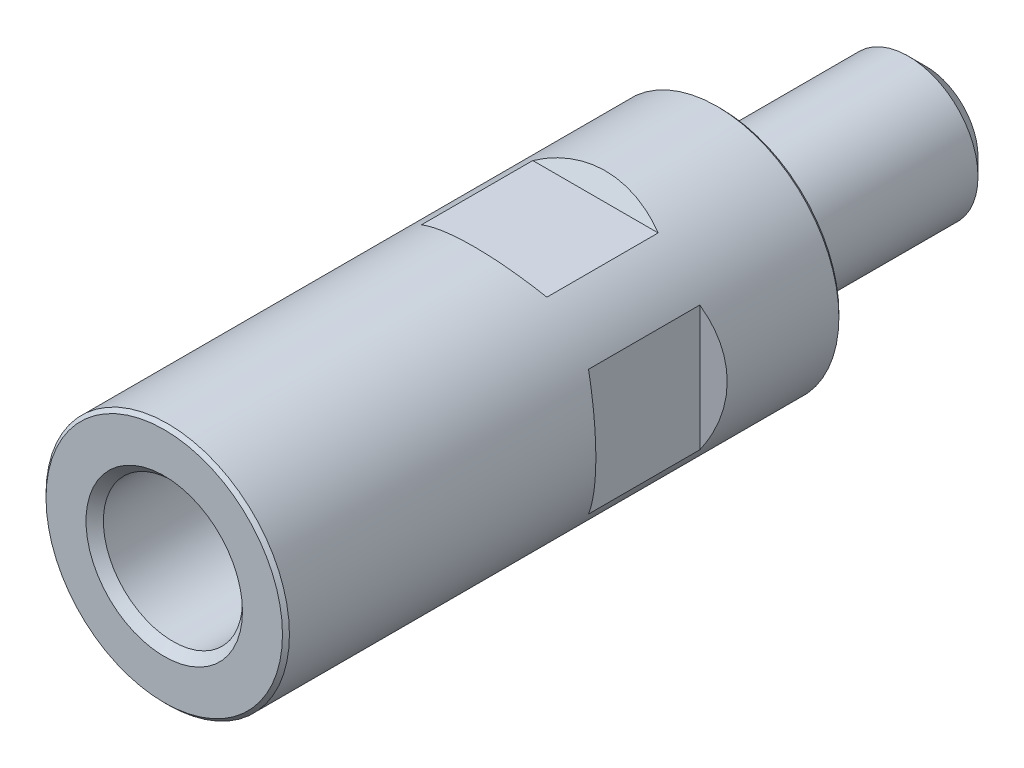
ISO-10303-21;
HEADER;
FILE_DESCRIPTION(('STEP AP214'),'2;1');
FILE_NAME('part.step','',(''),(''),'','','');
FILE_SCHEMA(('AUTOMOTIVE_DESIGN { 1 0 10303 214 1 1 1 1 }'));
ENDSEC;
DATA;
#1=APPLICATION_CONTEXT('core data for automotive mechanical design processes');
#2=APPLICATION_PROTOCOL_DEFINITION('international standard','automotive_design',2000,#1);
#3=PRODUCT_CONTEXT('',#1,'mechanical');
#4=PRODUCT('Part','Part','',(#3));
#5=PRODUCT_RELATED_PRODUCT_CATEGORY('part','',(#4));
#6=PRODUCT_DEFINITION_FORMATION('','',#4);
#7=PRODUCT_DEFINITION_CONTEXT('part definition',#1,'design');
#8=PRODUCT_DEFINITION('design','',#6,#7);
#9=PRODUCT_DEFINITION_SHAPE('','',#8);
#10=(LENGTH_UNIT() NAMED_UNIT(*) SI_UNIT(.MILLI.,.METRE.));
#11=(NAMED_UNIT(*) PLANE_ANGLE_UNIT() SI_UNIT($,.RADIAN.));
#12=(NAMED_UNIT(*) SI_UNIT($,.STERADIAN.) SOLID_ANGLE_UNIT());
#13=UNCERTAINTY_MEASURE_WITH_UNIT(LENGTH_MEASURE(1.E-05),#10,'distance_accuracy_value','');
#14=(GEOMETRIC_REPRESENTATION_CONTEXT(3) GLOBAL_UNCERTAINTY_ASSIGNED_CONTEXT((#13)) GLOBAL_UNIT_ASSIGNED_CONTEXT((#10,
#11,#12)) REPRESENTATION_CONTEXT('',''));
#15=CARTESIAN_POINT('',(0.,0.,0.));
#16=DIRECTION('',(0.,0.,1.));
#17=DIRECTION('',(1.,0.,0.));
#18=AXIS2_PLACEMENT_3D('',#15,#16,#17);
#19=CARTESIAN_POINT('',(0.,0.,2.5));
#20=DIRECTION('',(0.,0.,-1.));
#21=DIRECTION('',(-1.,0.,0.));
#22=AXIS2_PLACEMENT_3D('',#19,#20,#21);
#23=CONICAL_SURFACE('',#22,8.75,0.785398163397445);
#24=CARTESIAN_POINT('',(0.,0.,0.));
#25=DIRECTION('',(0.,0.,1.));
#26=DIRECTION('',(1.,0.,0.));
#27=AXIS2_PLACEMENT_3D('',#24,#25,#26);
#28=CIRCLE('',#27,11.25);
#29=CARTESIAN_POINT('',(11.25,0.,0.));
#30=VERTEX_POINT('',#29);
#31=EDGE_CURVE('E103',#30,#30,#28,.T.);
#32=ORIENTED_EDGE('',*,*,#31,.F.);
#33=EDGE_LOOP('',(#32));
#34=FACE_BOUND('',#33,.T.);
#35=CARTESIAN_POINT('',(0.,0.,1.25));
#36=DIRECTION('',(0.,0.,-1.));
#37=DIRECTION('',(-1.,0.,0.));
#38=AXIS2_PLACEMENT_3D('',#35,#36,#37);
#39=CIRCLE('',#38,10.);
#40=CARTESIAN_POINT('',(-10.,0.,1.25));
#41=VERTEX_POINT('',#40);
#42=EDGE_CURVE('E9',#41,#41,#39,.T.);
#43=ORIENTED_EDGE('',*,*,#42,.F.);
#44=EDGE_LOOP('',(#43));
#45=FACE_BOUND('',#44,.T.);
#46=ADVANCED_FACE('F14',(#34,#45),#23,.F.);
#47=CARTESIAN_POINT('',(0.,0.,80.));
#48=DIRECTION('',(0.,0.,-1.));
#49=DIRECTION('',(-1.,0.,0.));
#50=AXIS2_PLACEMENT_3D('',#47,#48,#49);
#51=CYLINDRICAL_SURFACE('',#50,17.5);
#52=CARTESIAN_POINT('',(0.,0.,0.5));
#53=DIRECTION('',(0.,0.,1.));
#54=DIRECTION('',(1.,0.,0.));
#55=AXIS2_PLACEMENT_3D('',#52,#53,#54);
#56=CIRCLE('',#55,17.5);
#57=CARTESIAN_POINT('',(17.5,0.,0.5));
#58=VERTEX_POINT('',#57);
#59=EDGE_CURVE('E160',#58,#58,#56,.T.);
#60=ORIENTED_EDGE('',*,*,#59,.T.);
#61=EDGE_LOOP('',(#60));
#62=FACE_BOUND('',#61,.T.);
#63=CARTESIAN_POINT('',(0.,0.,79.5));
#64=DIRECTION('',(0.,0.,1.));
#65=DIRECTION('',(1.,0.,0.));
#66=AXIS2_PLACEMENT_3D('',#63,#64,#65);
#67=CIRCLE('',#66,17.5);
#68=CARTESIAN_POINT('',(17.5,0.,79.5));
#69=VERTEX_POINT('',#68);
#70=EDGE_CURVE('E99',#69,#69,#67,.F.);
#71=ORIENTED_EDGE('',*,*,#70,.T.);
#72=EDGE_LOOP('',(#71));
#73=FACE_BOUND('',#72,.T.);
#74=CARTESIAN_POINT('',(0.,0.,26.6602540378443));
#75=DIRECTION('',(0.5,0.,-0.86602540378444));
#76=DIRECTION('',(-0.86602540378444,0.,-0.5));
#77=AXIS2_PLACEMENT_3D('',#74,#75,#76);
#78=ELLIPSE('',#77,20.2072594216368,17.5);
#79=CARTESIAN_POINT('',(-15.,-9.01387818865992,18.));
#80=VERTEX_POINT('',#79);
#81=CARTESIAN_POINT('',(-15.,9.01387818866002,18.));
#82=VERTEX_POINT('',#81);
#83=EDGE_CURVE('E81',#80,#82,#78,.T.);
#84=ORIENTED_EDGE('',*,*,#83,.T.);
#85=DIRECTION('',(0.,0.,-1.));
#86=VECTOR('',#85,1.);
#87=CARTESIAN_POINT('',(-15.,9.01387818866,80.));
#88=LINE('',#87,#86);
#89=CARTESIAN_POINT('',(-15.,9.01387818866,34.));
#90=VERTEX_POINT('',#89);
#91=EDGE_CURVE('E86',#82,#90,#88,.F.);
#92=ORIENTED_EDGE('',*,*,#91,.T.);
#93=CARTESIAN_POINT('',(0.,0.,25.3397459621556));
#94=DIRECTION('',(0.5,0.,0.86602540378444));
#95=DIRECTION('',(0.86602540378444,0.,-0.5));
#96=AXIS2_PLACEMENT_3D('',#93,#94,#95);
#97=ELLIPSE('',#96,20.2072594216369,17.5);
#98=CARTESIAN_POINT('',(-15.,-9.01387818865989,34.));
#99=VERTEX_POINT('',#98);
#100=EDGE_CURVE('E100',#90,#99,#97,.T.);
#101=ORIENTED_EDGE('',*,*,#100,.T.);
#102=DIRECTION('',(0.,0.,-1.));
#103=VECTOR('',#102,1.);
#104=CARTESIAN_POINT('',(-15.,-9.01387818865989,80.));
#105=LINE('',#104,#103);
#106=EDGE_CURVE('E87',#99,#80,#105,.T.);
#107=ORIENTED_EDGE('',*,*,#106,.T.);
#108=EDGE_LOOP('',(#84,#92,#101,#107));
#109=FACE_BOUND('',#108,.T.);
#110=CARTESIAN_POINT('',(0.,0.,26.6602540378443));
#111=DIRECTION('',(-0.5,0.,-0.86602540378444));
#112=DIRECTION('',(0.86602540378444,0.,-0.5));
#113=AXIS2_PLACEMENT_3D('',#110,#111,#112);
#114=ELLIPSE('',#113,20.2072594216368,17.5);
#115=CARTESIAN_POINT('',(15.,9.01387818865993,18.));
#116=VERTEX_POINT('',#115);
#117=CARTESIAN_POINT('',(15.,-9.01387818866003,18.));
#118=VERTEX_POINT('',#117);
#119=EDGE_CURVE('E91',#116,#118,#114,.T.);
#120=ORIENTED_EDGE('',*,*,#119,.T.);
#121=DIRECTION('',(0.,0.,-1.));
#122=VECTOR('',#121,1.);
#123=CARTESIAN_POINT('',(15.,-9.01387818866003,80.));
#124=LINE('',#123,#122);
#125=CARTESIAN_POINT('',(15.,-9.01387818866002,34.));
#126=VERTEX_POINT('',#125);
#127=EDGE_CURVE('E149',#118,#126,#124,.F.);
#128=ORIENTED_EDGE('',*,*,#127,.T.);
#129=CARTESIAN_POINT('',(0.,0.,25.3397459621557));
#130=DIRECTION('',(-0.5,0.,0.86602540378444));
#131=DIRECTION('',(-0.86602540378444,0.,-0.5));
#132=AXIS2_PLACEMENT_3D('',#129,#130,#131);
#133=ELLIPSE('',#132,20.2072594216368,17.5);
#134=CARTESIAN_POINT('',(15.,9.01387818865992,34.));
#135=VERTEX_POINT('',#134);
#136=EDGE_CURVE('E146',#126,#135,#133,.T.);
#137=ORIENTED_EDGE('',*,*,#136,.T.);
#138=DIRECTION('',(0.,0.,-1.));
#139=VECTOR('',#138,1.);
#140=CARTESIAN_POINT('',(15.,9.01387818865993,80.));
#141=LINE('',#140,#139);
#142=EDGE_CURVE('E152',#135,#116,#141,.T.);
#143=ORIENTED_EDGE('',*,*,#142,.T.);
#144=EDGE_LOOP('',(#120,#128,#137,#143));
#145=FACE_BOUND('',#144,.T.);
#146=CARTESIAN_POINT('',(0.,0.,26.6602540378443));
#147=DIRECTION('',(0.,0.5,-0.86602540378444));
#148=DIRECTION('',(0.,-0.86602540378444,-0.5));
#149=AXIS2_PLACEMENT_3D('',#146,#147,#148);
#150=ELLIPSE('',#149,20.2072594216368,17.5);
#151=CARTESIAN_POINT('',(9.01387818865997,-15.,18.));
#152=VERTEX_POINT('',#151);
#153=CARTESIAN_POINT('',(-9.01387818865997,-15.,18.));
#154=VERTEX_POINT('',#153);
#155=EDGE_CURVE('E135',#152,#154,#150,.T.);
#156=ORIENTED_EDGE('',*,*,#155,.T.);
#157=DIRECTION('',(0.,0.,-1.));
#158=VECTOR('',#157,1.);
#159=CARTESIAN_POINT('',(-9.01387818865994,-15.,80.));
#160=LINE('',#159,#158);
#161=CARTESIAN_POINT('',(-9.01387818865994,-15.,34.));
#162=VERTEX_POINT('',#161);
#163=EDGE_CURVE('E143',#154,#162,#160,.F.);
#164=ORIENTED_EDGE('',*,*,#163,.T.);
#165=CARTESIAN_POINT('',(0.,0.,25.3397459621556));
#166=DIRECTION('',(0.,0.5,0.86602540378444));
#167=DIRECTION('',(0.,0.86602540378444,-0.5));
#168=AXIS2_PLACEMENT_3D('',#165,#166,#167);
#169=ELLIPSE('',#168,20.2072594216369,17.5);
#170=CARTESIAN_POINT('',(9.01387818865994,-15.,34.));
#171=VERTEX_POINT('',#170);
#172=EDGE_CURVE('E140',#162,#171,#169,.T.);
#173=ORIENTED_EDGE('',*,*,#172,.T.);
#174=DIRECTION('',(0.,0.,-1.));
#175=VECTOR('',#174,1.);
#176=CARTESIAN_POINT('',(9.01387818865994,-15.,80.));
#177=LINE('',#176,#175);
#178=EDGE_CURVE('E137',#171,#152,#177,.T.);
#179=ORIENTED_EDGE('',*,*,#178,.T.);
#180=EDGE_LOOP('',(#156,#164,#173,#179));
#181=FACE_BOUND('',#180,.T.);
#182=CARTESIAN_POINT('',(0.,0.,26.6602540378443));
#183=DIRECTION('',(0.,-0.5,-0.86602540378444));
#184=DIRECTION('',(0.,0.86602540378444,-0.5));
#185=AXIS2_PLACEMENT_3D('',#182,#183,#184);
#186=ELLIPSE('',#185,20.2072594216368,17.5);
#187=CARTESIAN_POINT('',(-9.01387818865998,15.,18.));
#188=VERTEX_POINT('',#187);
#189=CARTESIAN_POINT('',(9.01387818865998,15.,18.));
#190=VERTEX_POINT('',#189);
#191=EDGE_CURVE('E133',#188,#190,#186,.T.);
#192=ORIENTED_EDGE('',*,*,#191,.T.);
#193=DIRECTION('',(0.,0.,-1.));
#194=VECTOR('',#193,1.);
#195=CARTESIAN_POINT('',(9.01387818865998,15.,80.));
#196=LINE('',#195,#194);
#197=CARTESIAN_POINT('',(9.01387818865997,15.,34.));
#198=VERTEX_POINT('',#197);
#199=EDGE_CURVE('E127',#190,#198,#196,.F.);
#200=ORIENTED_EDGE('',*,*,#199,.T.);
#201=CARTESIAN_POINT('',(0.,0.,25.3397459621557));
#202=DIRECTION('',(0.,-0.5,0.86602540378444));
#203=DIRECTION('',(0.,-0.86602540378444,-0.5));
#204=AXIS2_PLACEMENT_3D('',#201,#202,#203);
#205=ELLIPSE('',#204,20.2072594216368,17.5);
#206=CARTESIAN_POINT('',(-9.01387818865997,15.,34.));
#207=VERTEX_POINT('',#206);
#208=EDGE_CURVE('E123',#198,#207,#205,.T.);
#209=ORIENTED_EDGE('',*,*,#208,.T.);
#210=DIRECTION('',(0.,0.,-1.));
#211=VECTOR('',#210,1.);
#212=CARTESIAN_POINT('',(-9.01387818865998,15.,80.));
#213=LINE('',#212,#211);
#214=EDGE_CURVE('E130',#207,#188,#213,.T.);
#215=ORIENTED_EDGE('',*,*,#214,.T.);
#216=EDGE_LOOP('',(#192,#200,#209,#215));
#217=FACE_BOUND('',#216,.T.);
#218=ADVANCED_FACE('F83',(#62,#73,#109,#145,#181,#217),#51,.T.);
#219=CARTESIAN_POINT('',(0.,0.,80.));
#220=DIRECTION('',(0.,0.,1.));
#221=DIRECTION('',(1.,0.,0.));
#222=AXIS2_PLACEMENT_3D('',#219,#220,#221);
#223=PLANE('',#222);
#224=CARTESIAN_POINT('',(0.,0.,80.));
#225=DIRECTION('',(0.,0.,1.));
#226=DIRECTION('',(1.,0.,0.));
#227=AXIS2_PLACEMENT_3D('',#224,#225,#226);
#228=CIRCLE('',#227,17.);
#229=CARTESIAN_POINT('',(17.,0.,80.));
#230=VERTEX_POINT('',#229);
#231=EDGE_CURVE('E23',#230,#230,#228,.T.);
#232=ORIENTED_EDGE('',*,*,#231,.T.);
#233=EDGE_LOOP('',(#232));
#234=FACE_BOUND('',#233,.T.);
#235=CARTESIAN_POINT('',(0.,0.,80.));
#236=DIRECTION('',(0.,0.,1.));
#237=DIRECTION('',(1.,0.,0.));
#238=AXIS2_PLACEMENT_3D('',#235,#236,#237);
#239=CIRCLE('',#238,11.25);
#240=CARTESIAN_POINT('',(11.25,0.,80.));
#241=VERTEX_POINT('',#240);
#242=EDGE_CURVE('E107',#241,#241,#239,.T.);
#243=ORIENTED_EDGE('',*,*,#242,.F.);
#244=EDGE_LOOP('',(#243));
#245=FACE_BOUND('',#244,.T.);
#246=ADVANCED_FACE('F186',(#234,#245),#223,.T.);
#247=CARTESIAN_POINT('',(0.,0.,0.));
#248=DIRECTION('',(0.,0.,1.));
#249=DIRECTION('',(1.,0.,0.));
#250=AXIS2_PLACEMENT_3D('',#247,#248,#249);
#251=PLANE('',#250);
#252=CARTESIAN_POINT('',(0.,0.,0.));
#253=DIRECTION('',(0.,0.,1.));
#254=DIRECTION('',(1.,0.,0.));
#255=AXIS2_PLACEMENT_3D('',#252,#253,#254);
#256=CIRCLE('',#255,17.);
#257=CARTESIAN_POINT('',(17.,0.,0.));
#258=VERTEX_POINT('',#257);
#259=EDGE_CURVE('E163',#258,#258,#256,.F.);
#260=ORIENTED_EDGE('',*,*,#259,.T.);
#261=EDGE_LOOP('',(#260));
#262=FACE_BOUND('',#261,.T.);
#263=ORIENTED_EDGE('',*,*,#31,.T.);
#264=EDGE_LOOP('',(#263));
#265=FACE_BOUND('',#264,.T.);
#266=ADVANCED_FACE('F188',(#262,#265),#251,.F.);
#267=CARTESIAN_POINT('',(-10.,15.,18.));
#268=DIRECTION('',(0.,-0.5,-0.86602540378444));
#269=DIRECTION('',(0.,0.86602540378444,-0.5));
#270=AXIS2_PLACEMENT_3D('',#267,#268,#269);
#271=PLANE('',#270);
#272=ORIENTED_EDGE('',*,*,#191,.F.);
#273=DIRECTION('',(1.,0.,0.));
#274=VECTOR('',#273,1.);
#275=CARTESIAN_POINT('',(-10.,15.,18.));
#276=LINE('',#275,#274);
#277=EDGE_CURVE('E120',#188,#190,#276,.T.);
#278=ORIENTED_EDGE('',*,*,#277,.T.);
#279=EDGE_LOOP('',(#272,#278));
#280=FACE_BOUND('',#279,.T.);
#281=ADVANCED_FACE('F196',(#280),#271,.F.);
#282=CARTESIAN_POINT('',(-10.,15.,34.));
#283=DIRECTION('',(0.,-1.,0.));
#284=DIRECTION('',(0.,0.,-1.));
#285=AXIS2_PLACEMENT_3D('',#282,#283,#284);
#286=PLANE('',#285);
#287=DIRECTION('',(1.,0.,0.));
#288=VECTOR('',#287,1.);
#289=CARTESIAN_POINT('',(-10.,15.,34.));
#290=LINE('',#289,#288);
#291=EDGE_CURVE('E37',#207,#198,#290,.T.);
#292=ORIENTED_EDGE('',*,*,#291,.T.);
#293=ORIENTED_EDGE('',*,*,#199,.F.);
#294=ORIENTED_EDGE('',*,*,#277,.F.);
#295=ORIENTED_EDGE('',*,*,#214,.F.);
#296=EDGE_LOOP('',(#292,#293,#294,#295));
#297=FACE_BOUND('',#296,.T.);
#298=ADVANCED_FACE('F277',(#297),#286,.F.);
#299=CARTESIAN_POINT('',(-10.,17.5,35.443375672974));
#300=DIRECTION('',(0.,-0.5,0.86602540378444));
#301=DIRECTION('',(0.,-0.86602540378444,-0.5));
#302=AXIS2_PLACEMENT_3D('',#299,#300,#301);
#303=PLANE('',#302);
#304=ORIENTED_EDGE('',*,*,#291,.F.);
#305=ORIENTED_EDGE('',*,*,#208,.F.);
#306=EDGE_LOOP('',(#304,#305));
#307=FACE_BOUND('',#306,.T.);
#308=ADVANCED_FACE('F273',(#307),#303,.F.);
#309=CARTESIAN_POINT('',(-10.,-17.5,35.443375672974));
#310=DIRECTION('',(0.,0.5,0.86602540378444));
#311=DIRECTION('',(0.,-0.86602540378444,0.5));
#312=AXIS2_PLACEMENT_3D('',#309,#310,#311);
#313=PLANE('',#312);
#314=DIRECTION('',(1.,0.,0.));
#315=VECTOR('',#314,1.);
#316=CARTESIAN_POINT('',(-10.,-15.,34.));
#317=LINE('',#316,#315);
#318=EDGE_CURVE('E115',#162,#171,#317,.T.);
#319=ORIENTED_EDGE('',*,*,#318,.T.);
#320=ORIENTED_EDGE('',*,*,#172,.F.);
#321=EDGE_LOOP('',(#319,#320));
#322=FACE_BOUND('',#321,.T.);
#323=ADVANCED_FACE('F266',(#322),#313,.F.);
#324=CARTESIAN_POINT('',(-10.,-15.,34.));
#325=DIRECTION('',(0.,1.,0.));
#326=DIRECTION('',(0.,0.,1.));
#327=AXIS2_PLACEMENT_3D('',#324,#325,#326);
#328=PLANE('',#327);
#329=ORIENTED_EDGE('',*,*,#318,.F.);
#330=ORIENTED_EDGE('',*,*,#163,.F.);
#331=DIRECTION('',(1.,0.,0.));
#332=VECTOR('',#331,1.);
#333=CARTESIAN_POINT('',(-10.,-15.,18.));
#334=LINE('',#333,#332);
#335=EDGE_CURVE('E113',#154,#152,#334,.T.);
#336=ORIENTED_EDGE('',*,*,#335,.T.);
#337=ORIENTED_EDGE('',*,*,#178,.F.);
#338=EDGE_LOOP('',(#329,#330,#336,#337));
#339=FACE_BOUND('',#338,.T.);
#340=ADVANCED_FACE('F263',(#339),#328,.F.);
#341=CARTESIAN_POINT('',(-10.,-15.,18.));
#342=DIRECTION('',(0.,0.5,-0.86602540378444));
#343=DIRECTION('',(0.,0.86602540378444,0.5));
#344=AXIS2_PLACEMENT_3D('',#341,#342,#343);
#345=PLANE('',#344);
#346=ORIENTED_EDGE('',*,*,#155,.F.);
#347=ORIENTED_EDGE('',*,*,#335,.F.);
#348=EDGE_LOOP('',(#346,#347));
#349=FACE_BOUND('',#348,.T.);
#350=ADVANCED_FACE('F256',(#349),#345,.F.);
#351=CARTESIAN_POINT('',(15.,10.,18.));
#352=DIRECTION('',(-0.5,0.,-0.86602540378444));
#353=DIRECTION('',(-0.86602540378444,0.,0.5));
#354=AXIS2_PLACEMENT_3D('',#351,#352,#353);
#355=PLANE('',#354);
#356=ORIENTED_EDGE('',*,*,#119,.F.);
#357=DIRECTION('',(0.,-1.,0.));
#358=VECTOR('',#357,1.);
#359=CARTESIAN_POINT('',(15.,10.,18.));
#360=LINE('',#359,#358);
#361=EDGE_CURVE('E110',#116,#118,#360,.T.);
#362=ORIENTED_EDGE('',*,*,#361,.T.);
#363=EDGE_LOOP('',(#356,#362));
#364=FACE_BOUND('',#363,.T.);
#365=ADVANCED_FACE('F252',(#364),#355,.F.);
#366=CARTESIAN_POINT('',(15.,10.,34.));
#367=DIRECTION('',(-1.,0.,0.));
#368=DIRECTION('',(0.,-1.,0.));
#369=AXIS2_PLACEMENT_3D('',#366,#367,#368);
#370=PLANE('',#369);
#371=DIRECTION('',(0.,-1.,0.));
#372=VECTOR('',#371,1.);
#373=CARTESIAN_POINT('',(15.,10.,34.));
#374=LINE('',#373,#372);
#375=EDGE_CURVE('E30',#135,#126,#374,.T.);
#376=ORIENTED_EDGE('',*,*,#375,.T.);
#377=ORIENTED_EDGE('',*,*,#127,.F.);
#378=ORIENTED_EDGE('',*,*,#361,.F.);
#379=ORIENTED_EDGE('',*,*,#142,.F.);
#380=EDGE_LOOP('',(#376,#377,#378,#379));
#381=FACE_BOUND('',#380,.T.);
#382=ADVANCED_FACE('F255',(#381),#370,.F.);
#383=CARTESIAN_POINT('',(17.5,10.,35.443375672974));
#384=DIRECTION('',(-0.5,0.,0.86602540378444));
#385=DIRECTION('',(0.86602540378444,0.,0.5));
#386=AXIS2_PLACEMENT_3D('',#383,#384,#385);
#387=PLANE('',#386);
#388=ORIENTED_EDGE('',*,*,#375,.F.);
#389=ORIENTED_EDGE('',*,*,#136,.F.);
#390=EDGE_LOOP('',(#388,#389));
#391=FACE_BOUND('',#390,.T.);
#392=ADVANCED_FACE('F250',(#391),#387,.F.);
#393=CARTESIAN_POINT('',(-17.5,10.,35.443375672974));
#394=DIRECTION('',(0.5,0.,0.86602540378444));
#395=DIRECTION('',(0.86602540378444,0.,-0.5));
#396=AXIS2_PLACEMENT_3D('',#393,#394,#395);
#397=PLANE('',#396);
#398=DIRECTION('',(0.,-1.,0.));
#399=VECTOR('',#398,1.);
#400=CARTESIAN_POINT('',(-15.,10.,34.));
#401=LINE('',#400,#399);
#402=EDGE_CURVE('E98',#90,#99,#401,.T.);
#403=ORIENTED_EDGE('',*,*,#402,.T.);
#404=ORIENTED_EDGE('',*,*,#100,.F.);
#405=EDGE_LOOP('',(#403,#404));
#406=FACE_BOUND('',#405,.T.);
#407=ADVANCED_FACE('F245',(#406),#397,.F.);
#408=CARTESIAN_POINT('',(-15.,10.,34.));
#409=DIRECTION('',(1.,0.,0.));
#410=DIRECTION('',(0.,1.,0.));
#411=AXIS2_PLACEMENT_3D('',#408,#409,#410);
#412=PLANE('',#411);
#413=ORIENTED_EDGE('',*,*,#402,.F.);
#414=ORIENTED_EDGE('',*,*,#91,.F.);
#415=DIRECTION('',(0.,-1.,0.));
#416=VECTOR('',#415,1.);
#417=CARTESIAN_POINT('',(-15.,10.,18.));
#418=LINE('',#417,#416);
#419=EDGE_CURVE('E96',#82,#80,#418,.T.);
#420=ORIENTED_EDGE('',*,*,#419,.T.);
#421=ORIENTED_EDGE('',*,*,#106,.F.);
#422=EDGE_LOOP('',(#413,#414,#420,#421));
#423=FACE_BOUND('',#422,.T.);
#424=ADVANCED_FACE('F95',(#423),#412,.F.);
#425=CARTESIAN_POINT('',(-15.,10.,18.));
#426=DIRECTION('',(0.5,0.,-0.86602540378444));
#427=DIRECTION('',(-0.86602540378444,0.,-0.5));
#428=AXIS2_PLACEMENT_3D('',#425,#426,#427);
#429=PLANE('',#428);
#430=ORIENTED_EDGE('',*,*,#83,.F.);
#431=ORIENTED_EDGE('',*,*,#419,.F.);
#432=EDGE_LOOP('',(#430,#431));
#433=FACE_BOUND('',#432,.T.);
#434=ADVANCED_FACE('F102',(#433),#429,.F.);
#435=CARTESIAN_POINT('',(0.,0.,80.));
#436=DIRECTION('',(0.,0.,1.));
#437=DIRECTION('',(1.,0.,0.));
#438=AXIS2_PLACEMENT_3D('',#435,#436,#437);
#439=CONICAL_SURFACE('',#438,11.25,0.78539816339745);
#440=CARTESIAN_POINT('',(0.,0.,78.75));
#441=DIRECTION('',(0.,0.,1.));
#442=DIRECTION('',(1.,0.,0.));
#443=AXIS2_PLACEMENT_3D('',#440,#441,#442);
#444=CIRCLE('',#443,10.);
#445=CARTESIAN_POINT('',(10.,0.,78.75));
#446=VERTEX_POINT('',#445);
#447=EDGE_CURVE('E168',#446,#446,#444,.F.);
#448=ORIENTED_EDGE('',*,*,#447,.T.);
#449=EDGE_LOOP('',(#448));
#450=FACE_BOUND('',#449,.T.);
#451=ORIENTED_EDGE('',*,*,#242,.T.);
#452=EDGE_LOOP('',(#451));
#453=FACE_BOUND('',#452,.T.);
#454=ADVANCED_FACE('F184',(#450,#453),#439,.F.);
#455=CARTESIAN_POINT('',(0.,0.,0.5));
#456=DIRECTION('',(0.,0.,1.));
#457=DIRECTION('',(1.,0.,0.));
#458=AXIS2_PLACEMENT_3D('',#455,#456,#457);
#459=CONICAL_SURFACE('',#458,17.5,0.785398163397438);
#460=ORIENTED_EDGE('',*,*,#259,.F.);
#461=EDGE_LOOP('',(#460));
#462=FACE_BOUND('',#461,.T.);
#463=ORIENTED_EDGE('',*,*,#59,.F.);
#464=EDGE_LOOP('',(#463));
#465=FACE_BOUND('',#464,.T.);
#466=ADVANCED_FACE('F221',(#462,#465),#459,.T.);
#467=CARTESIAN_POINT('',(0.,0.,80.));
#468=DIRECTION('',(0.,0.,-1.));
#469=DIRECTION('',(-1.,0.,0.));
#470=AXIS2_PLACEMENT_3D('',#467,#468,#469);
#471=CONICAL_SURFACE('',#470,17.,0.785398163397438);
#472=ORIENTED_EDGE('',*,*,#70,.F.);
#473=EDGE_LOOP('',(#472));
#474=FACE_BOUND('',#473,.T.);
#475=ORIENTED_EDGE('',*,*,#231,.F.);
#476=EDGE_LOOP('',(#475));
#477=FACE_BOUND('',#476,.T.);
#478=ADVANCED_FACE('F212',(#474,#477),#471,.T.);
#479=CARTESIAN_POINT('',(0.,0.,21.));
#480=DIRECTION('',(0.,0.,1.));
#481=DIRECTION('',(1.,0.,0.));
#482=AXIS2_PLACEMENT_3D('',#479,#480,#481);
#483=CYLINDRICAL_SURFACE('',#482,10.);
#484=CARTESIAN_POINT('',(0.,0.,30.));
#485=DIRECTION('',(0.,0.,1.));
#486=DIRECTION('',(1.,0.,0.));
#487=AXIS2_PLACEMENT_3D('',#484,#485,#486);
#488=CIRCLE('',#487,10.);
#489=CARTESIAN_POINT('',(10.,0.,30.));
#490=VERTEX_POINT('',#489);
#491=EDGE_CURVE('E172',#490,#490,#488,.T.);
#492=ORIENTED_EDGE('',*,*,#491,.F.);
#493=EDGE_LOOP('',(#492));
#494=FACE_BOUND('',#493,.T.);
#495=ORIENTED_EDGE('',*,*,#447,.F.);
#496=EDGE_LOOP('',(#495));
#497=FACE_BOUND('',#496,.T.);
#498=ADVANCED_FACE('F204',(#494,#497),#483,.F.);
#499=CARTESIAN_POINT('',(0.,0.,-29.5));
#500=DIRECTION('',(0.,0.,1.));
#501=DIRECTION('',(1.,0.,0.));
#502=AXIS2_PLACEMENT_3D('',#499,#500,#501);
#503=PLANE('',#502);
#504=CARTESIAN_POINT('',(0.,0.,-29.5));
#505=DIRECTION('',(0.,0.,1.));
#506=DIRECTION('',(1.,0.,0.));
#507=AXIS2_PLACEMENT_3D('',#504,#505,#506);
#508=CIRCLE('',#507,7.5);
#509=CARTESIAN_POINT('',(7.5,0.,-29.5));
#510=VERTEX_POINT('',#509);
#511=EDGE_CURVE('E18',#510,#510,#508,.T.);
#512=ORIENTED_EDGE('',*,*,#511,.F.);
#513=EDGE_LOOP('',(#512));
#514=FACE_BOUND('',#513,.T.);
#515=ADVANCED_FACE('F16',(#514),#503,.F.);
#516=CARTESIAN_POINT('',(0.,0.,-27.));
#517=DIRECTION('',(0.,0.,1.));
#518=DIRECTION('',(1.,0.,0.));
#519=AXIS2_PLACEMENT_3D('',#516,#517,#518);
#520=CONICAL_SURFACE('',#519,10.,0.785398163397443);
#521=ORIENTED_EDGE('',*,*,#511,.T.);
#522=EDGE_LOOP('',(#521));
#523=FACE_BOUND('',#522,.T.);
#524=CARTESIAN_POINT('',(0.,0.,-27.));
#525=DIRECTION('',(0.,0.,1.));
#526=DIRECTION('',(1.,0.,0.));
#527=AXIS2_PLACEMENT_3D('',#524,#525,#526);
#528=CIRCLE('',#527,10.);
#529=CARTESIAN_POINT('',(10.,0.,-27.));
#530=VERTEX_POINT('',#529);
#531=EDGE_CURVE('E170',#530,#530,#528,.T.);
#532=ORIENTED_EDGE('',*,*,#531,.F.);
#533=EDGE_LOOP('',(#532));
#534=FACE_BOUND('',#533,.T.);
#535=ADVANCED_FACE('F203',(#523,#534),#520,.T.);
#536=CARTESIAN_POINT('',(0.,0.,-9.5));
#537=DIRECTION('',(0.,0.,1.));
#538=DIRECTION('',(1.,0.,0.));
#539=AXIS2_PLACEMENT_3D('',#536,#537,#538);
#540=CYLINDRICAL_SURFACE('',#539,10.);
#541=ORIENTED_EDGE('',*,*,#531,.T.);
#542=EDGE_LOOP('',(#541));
#543=FACE_BOUND('',#542,.T.);
#544=ORIENTED_EDGE('',*,*,#42,.T.);
#545=EDGE_LOOP('',(#544));
#546=FACE_BOUND('',#545,.T.);
#547=ADVANCED_FACE('F210',(#543,#546),#540,.T.);
#548=CARTESIAN_POINT('',(0.,0.,30.));
#549=DIRECTION('',(0.,0.,1.));
#550=DIRECTION('',(1.,0.,0.));
#551=AXIS2_PLACEMENT_3D('',#548,#549,#550);
#552=PLANE('',#551);
#553=ORIENTED_EDGE('',*,*,#491,.T.);
#554=EDGE_LOOP('',(#553));
#555=FACE_BOUND('',#554,.T.);
#556=ADVANCED_FACE('F215',(#555),#552,.T.);
#557=CLOSED_SHELL('',(#46,#218,#246,#266,#281,#298,#308,#323,#340,#350,#365,#382,#392,#407,#424,
#434,#454,#466,#478,#498,#515,#535,#547,#556));
#558=MANIFOLD_SOLID_BREP('B1',#557);
#559=ADVANCED_BREP_SHAPE_REPRESENTATION('',(#18,#558),#14);
#560=SHAPE_DEFINITION_REPRESENTATION(#9,#559);
ENDSEC;
END-ISO-10303-21;
